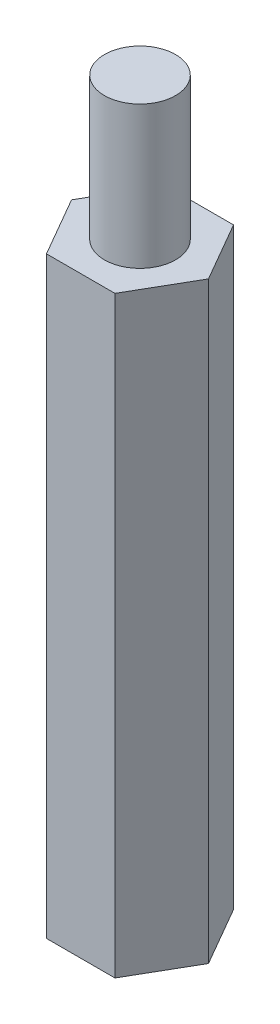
ISO-10303-21;
HEADER;
FILE_DESCRIPTION(('STEP AP214'),'2;1');
FILE_NAME('part.step','',(''),(''),'','','');
FILE_SCHEMA(('AUTOMOTIVE_DESIGN { 1 0 10303 214 1 1 1 1 }'));
ENDSEC;
DATA;
#1=APPLICATION_CONTEXT('core data for automotive mechanical design processes');
#2=APPLICATION_PROTOCOL_DEFINITION('international standard','automotive_design',2000,#1);
#3=PRODUCT_CONTEXT('',#1,'mechanical');
#4=PRODUCT('Part','Part','',(#3));
#5=PRODUCT_RELATED_PRODUCT_CATEGORY('part','',(#4));
#6=PRODUCT_DEFINITION_FORMATION('','',#4);
#7=PRODUCT_DEFINITION_CONTEXT('part definition',#1,'design');
#8=PRODUCT_DEFINITION('design','',#6,#7);
#9=PRODUCT_DEFINITION_SHAPE('','',#8);
#10=(LENGTH_UNIT() NAMED_UNIT(*) SI_UNIT(.MILLI.,.METRE.));
#11=(NAMED_UNIT(*) PLANE_ANGLE_UNIT() SI_UNIT($,.RADIAN.));
#12=(NAMED_UNIT(*) SI_UNIT($,.STERADIAN.) SOLID_ANGLE_UNIT());
#13=UNCERTAINTY_MEASURE_WITH_UNIT(LENGTH_MEASURE(1.E-05),#10,'distance_accuracy_value','');
#14=(GEOMETRIC_REPRESENTATION_CONTEXT(3) GLOBAL_UNCERTAINTY_ASSIGNED_CONTEXT((#13)) GLOBAL_UNIT_ASSIGNED_CONTEXT((#10,
#11,#12)) REPRESENTATION_CONTEXT('',''));
#15=CARTESIAN_POINT('',(0.,0.,0.));
#16=DIRECTION('',(0.,0.,1.));
#17=DIRECTION('',(1.,0.,0.));
#18=AXIS2_PLACEMENT_3D('',#15,#16,#17);
#19=CARTESIAN_POINT('',(0.,31.,0.));
#20=DIRECTION('',(0.,-1.,0.));
#21=DIRECTION('',(0.,0.,-1.));
#22=AXIS2_PLACEMENT_3D('',#19,#20,#21);
#23=CYLINDRICAL_SURFACE('',#22,1.5);
#24=CARTESIAN_POINT('',(0.,31.,0.));
#25=DIRECTION('',(0.,1.,0.));
#26=DIRECTION('',(0.,0.,1.));
#27=AXIS2_PLACEMENT_3D('',#24,#25,#26);
#28=CIRCLE('',#27,1.5);
#29=CARTESIAN_POINT('',(0.,31.,1.5));
#30=VERTEX_POINT('',#29);
#31=EDGE_CURVE('E11',#30,#30,#28,.T.);
#32=ORIENTED_EDGE('',*,*,#31,.F.);
#33=EDGE_LOOP('',(#32));
#34=FACE_BOUND('',#33,.T.);
#35=CARTESIAN_POINT('',(0.,25.,0.));
#36=DIRECTION('',(0.,1.,0.));
#37=DIRECTION('',(0.,0.,1.));
#38=AXIS2_PLACEMENT_3D('',#35,#36,#37);
#39=CIRCLE('',#38,1.5);
#40=CARTESIAN_POINT('',(0.,25.,1.5));
#41=VERTEX_POINT('',#40);
#42=EDGE_CURVE('E48',#41,#41,#39,.T.);
#43=ORIENTED_EDGE('',*,*,#42,.T.);
#44=EDGE_LOOP('',(#43));
#45=FACE_BOUND('',#44,.T.);
#46=ADVANCED_FACE('F45',(#34,#45),#23,.T.);
#47=CARTESIAN_POINT('',(0.,31.,0.));
#48=DIRECTION('',(0.,1.,0.));
#49=DIRECTION('',(0.,0.,1.));
#50=AXIS2_PLACEMENT_3D('',#47,#48,#49);
#51=PLANE('',#50);
#52=ORIENTED_EDGE('',*,*,#31,.T.);
#53=EDGE_LOOP('',(#52));
#54=FACE_BOUND('',#53,.T.);
#55=ADVANCED_FACE('F60',(#54),#51,.T.);
#56=CARTESIAN_POINT('',(0.,25.,0.));
#57=DIRECTION('',(0.,1.,0.));
#58=DIRECTION('',(0.,0.,1.));
#59=AXIS2_PLACEMENT_3D('',#56,#57,#58);
#60=PLANE('',#59);
#61=ORIENTED_EDGE('',*,*,#42,.F.);
#62=EDGE_LOOP('',(#61));
#63=FACE_BOUND('',#62,.T.);
#64=ADVANCED_FACE('F58',(#63),#60,.F.);
#65=CLOSED_SHELL('',(#46,#55,#64));
#66=MANIFOLD_SOLID_BREP('B2',#65);
#67=CARTESIAN_POINT('',(0.,25.,0.));
#68=DIRECTION('',(0.,1.,0.));
#69=DIRECTION('',(0.,0.,1.));
#70=AXIS2_PLACEMENT_3D('',#67,#68,#69);
#71=PLANE('',#70);
#72=DIRECTION('',(0.500000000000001,0.,-0.866025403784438));
#73=VECTOR('',#72,1.);
#74=CARTESIAN_POINT('',(1.44337567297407,25.,2.5));
#75=LINE('',#74,#73);
#76=CARTESIAN_POINT('',(1.44337567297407,25.,2.5));
#77=VERTEX_POINT('',#76);
#78=CARTESIAN_POINT('',(2.88675134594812,25.,0.));
#79=VERTEX_POINT('',#78);
#80=EDGE_CURVE('E182',#77,#79,#75,.T.);
#81=ORIENTED_EDGE('',*,*,#80,.T.);
#82=DIRECTION('',(-0.499999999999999,0.,-0.866025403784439));
#83=VECTOR('',#82,1.);
#84=CARTESIAN_POINT('',(2.88675134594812,25.,0.));
#85=LINE('',#84,#83);
#86=CARTESIAN_POINT('',(1.44337567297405,25.,-2.5));
#87=VERTEX_POINT('',#86);
#88=EDGE_CURVE('E140',#79,#87,#85,.T.);
#89=ORIENTED_EDGE('',*,*,#88,.T.);
#90=DIRECTION('',(-1.,0.,0.));
#91=VECTOR('',#90,1.);
#92=CARTESIAN_POINT('',(1.44337567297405,25.,-2.5));
#93=LINE('',#92,#91);
#94=CARTESIAN_POINT('',(-1.44337567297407,25.,-2.5));
#95=VERTEX_POINT('',#94);
#96=EDGE_CURVE('E153',#87,#95,#93,.T.);
#97=ORIENTED_EDGE('',*,*,#96,.T.);
#98=DIRECTION('',(-0.5,0.,0.866025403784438));
#99=VECTOR('',#98,1.);
#100=CARTESIAN_POINT('',(-1.44337567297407,25.,-2.5));
#101=LINE('',#100,#99);
#102=CARTESIAN_POINT('',(-2.88675134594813,25.,0.));
#103=VERTEX_POINT('',#102);
#104=EDGE_CURVE('E147',#95,#103,#101,.T.);
#105=ORIENTED_EDGE('',*,*,#104,.T.);
#106=DIRECTION('',(0.5,0.,0.866025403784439));
#107=VECTOR('',#106,1.);
#108=CARTESIAN_POINT('',(-2.88675134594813,25.,0.));
#109=LINE('',#108,#107);
#110=CARTESIAN_POINT('',(-1.44337567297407,25.,2.5));
#111=VERTEX_POINT('',#110);
#112=EDGE_CURVE('E151',#103,#111,#109,.T.);
#113=ORIENTED_EDGE('',*,*,#112,.T.);
#114=DIRECTION('',(1.,0.,0.));
#115=VECTOR('',#114,1.);
#116=CARTESIAN_POINT('',(-1.44337567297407,25.,2.5));
#117=LINE('',#116,#115);
#118=EDGE_CURVE('E103',#111,#77,#117,.T.);
#119=ORIENTED_EDGE('',*,*,#118,.T.);
#120=EDGE_LOOP('',(#81,#89,#97,#105,#113,#119));
#121=FACE_BOUND('',#120,.T.);
#122=CARTESIAN_POINT('',(0.,25.,0.));
#123=DIRECTION('',(0.,1.,0.));
#124=DIRECTION('',(0.,0.,1.));
#125=AXIS2_PLACEMENT_3D('',#122,#123,#124);
#126=CIRCLE('',#125,1.5);
#127=CARTESIAN_POINT('',(0.,25.,1.5));
#128=VERTEX_POINT('',#127);
#129=EDGE_CURVE('E175',#128,#128,#126,.T.);
#130=ORIENTED_EDGE('',*,*,#129,.F.);
#131=EDGE_LOOP('',(#130));
#132=FACE_BOUND('',#131,.T.);
#133=ADVANCED_FACE('F86',(#121,#132),#71,.T.);
#134=CARTESIAN_POINT('',(0.,0.,0.));
#135=DIRECTION('',(0.,1.,0.));
#136=DIRECTION('',(0.,0.,1.));
#137=AXIS2_PLACEMENT_3D('',#134,#135,#136);
#138=PLANE('',#137);
#139=DIRECTION('',(0.500000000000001,0.,-0.866025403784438));
#140=VECTOR('',#139,1.);
#141=CARTESIAN_POINT('',(1.44337567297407,0.,2.5));
#142=LINE('',#141,#140);
#143=CARTESIAN_POINT('',(1.44337567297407,0.,2.5));
#144=VERTEX_POINT('',#143);
#145=CARTESIAN_POINT('',(2.88675134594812,0.,0.));
#146=VERTEX_POINT('',#145);
#147=EDGE_CURVE('E171',#144,#146,#142,.T.);
#148=ORIENTED_EDGE('',*,*,#147,.F.);
#149=DIRECTION('',(1.,0.,0.));
#150=VECTOR('',#149,1.);
#151=CARTESIAN_POINT('',(-1.44337567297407,0.,2.5));
#152=LINE('',#151,#150);
#153=CARTESIAN_POINT('',(-1.44337567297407,0.,2.5));
#154=VERTEX_POINT('',#153);
#155=EDGE_CURVE('E132',#154,#144,#152,.T.);
#156=ORIENTED_EDGE('',*,*,#155,.F.);
#157=DIRECTION('',(0.5,0.,0.866025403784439));
#158=VECTOR('',#157,1.);
#159=CARTESIAN_POINT('',(-2.88675134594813,0.,0.));
#160=LINE('',#159,#158);
#161=CARTESIAN_POINT('',(-2.88675134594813,0.,0.));
#162=VERTEX_POINT('',#161);
#163=EDGE_CURVE('E126',#162,#154,#160,.T.);
#164=ORIENTED_EDGE('',*,*,#163,.F.);
#165=DIRECTION('',(-0.5,0.,0.866025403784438));
#166=VECTOR('',#165,1.);
#167=CARTESIAN_POINT('',(-1.44337567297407,0.,-2.5));
#168=LINE('',#167,#166);
#169=CARTESIAN_POINT('',(-1.44337567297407,0.,-2.5));
#170=VERTEX_POINT('',#169);
#171=EDGE_CURVE('E161',#170,#162,#168,.T.);
#172=ORIENTED_EDGE('',*,*,#171,.F.);
#173=DIRECTION('',(-1.,0.,0.));
#174=VECTOR('',#173,1.);
#175=CARTESIAN_POINT('',(1.44337567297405,0.,-2.5));
#176=LINE('',#175,#174);
#177=CARTESIAN_POINT('',(1.44337567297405,0.,-2.5));
#178=VERTEX_POINT('',#177);
#179=EDGE_CURVE('E177',#178,#170,#176,.T.);
#180=ORIENTED_EDGE('',*,*,#179,.F.);
#181=DIRECTION('',(-0.499999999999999,0.,-0.866025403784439));
#182=VECTOR('',#181,1.);
#183=CARTESIAN_POINT('',(2.88675134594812,0.,0.));
#184=LINE('',#183,#182);
#185=EDGE_CURVE('E174',#146,#178,#184,.T.);
#186=ORIENTED_EDGE('',*,*,#185,.F.);
#187=EDGE_LOOP('',(#148,#156,#164,#172,#180,#186));
#188=FACE_BOUND('',#187,.T.);
#189=CARTESIAN_POINT('',(0.,0.,0.));
#190=DIRECTION('',(0.,1.,0.));
#191=DIRECTION('',(0.,0.,1.));
#192=AXIS2_PLACEMENT_3D('',#189,#190,#191);
#193=CIRCLE('',#192,1.5);
#194=CARTESIAN_POINT('',(0.,0.,1.5));
#195=VERTEX_POINT('',#194);
#196=EDGE_CURVE('E275',#195,#195,#193,.T.);
#197=ORIENTED_EDGE('',*,*,#196,.T.);
#198=EDGE_LOOP('',(#197));
#199=FACE_BOUND('',#198,.T.);
#200=ADVANCED_FACE('F191',(#188,#199),#138,.F.);
#201=CARTESIAN_POINT('',(1.44337567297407,25.,2.5));
#202=DIRECTION('',(-0.866025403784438,0.,-0.500000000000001));
#203=DIRECTION('',(-0.500000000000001,0.,0.866025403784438));
#204=AXIS2_PLACEMENT_3D('',#201,#202,#203);
#205=PLANE('',#204);
#206=ORIENTED_EDGE('',*,*,#147,.T.);
#207=DIRECTION('',(0.,-1.,0.));
#208=VECTOR('',#207,1.);
#209=CARTESIAN_POINT('',(2.88675134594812,25.,0.));
#210=LINE('',#209,#208);
#211=EDGE_CURVE('E43',#79,#146,#210,.T.);
#212=ORIENTED_EDGE('',*,*,#211,.F.);
#213=ORIENTED_EDGE('',*,*,#80,.F.);
#214=DIRECTION('',(0.,-1.,0.));
#215=VECTOR('',#214,1.);
#216=CARTESIAN_POINT('',(1.44337567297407,25.,2.5));
#217=LINE('',#216,#215);
#218=EDGE_CURVE('E167',#77,#144,#217,.T.);
#219=ORIENTED_EDGE('',*,*,#218,.T.);
#220=EDGE_LOOP('',(#206,#212,#213,#219));
#221=FACE_BOUND('',#220,.T.);
#222=ADVANCED_FACE('F88',(#221),#205,.F.);
#223=CARTESIAN_POINT('',(2.88675134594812,25.,0.));
#224=DIRECTION('',(-0.866025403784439,0.,0.499999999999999));
#225=DIRECTION('',(0.5,0.,0.866025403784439));
#226=AXIS2_PLACEMENT_3D('',#223,#224,#225);
#227=PLANE('',#226);
#228=ORIENTED_EDGE('',*,*,#185,.T.);
#229=DIRECTION('',(0.,-1.,0.));
#230=VECTOR('',#229,1.);
#231=CARTESIAN_POINT('',(1.44337567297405,25.,-2.5));
#232=LINE('',#231,#230);
#233=EDGE_CURVE('E95',#87,#178,#232,.T.);
#234=ORIENTED_EDGE('',*,*,#233,.F.);
#235=ORIENTED_EDGE('',*,*,#88,.F.);
#236=ORIENTED_EDGE('',*,*,#211,.T.);
#237=EDGE_LOOP('',(#228,#234,#235,#236));
#238=FACE_BOUND('',#237,.T.);
#239=ADVANCED_FACE('F216',(#238),#227,.F.);
#240=CARTESIAN_POINT('',(1.44337567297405,25.,-2.5));
#241=DIRECTION('',(0.,0.,1.));
#242=DIRECTION('',(1.,0.,0.));
#243=AXIS2_PLACEMENT_3D('',#240,#241,#242);
#244=PLANE('',#243);
#245=ORIENTED_EDGE('',*,*,#179,.T.);
#246=DIRECTION('',(0.,-1.,0.));
#247=VECTOR('',#246,1.);
#248=CARTESIAN_POINT('',(-1.44337567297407,25.,-2.5));
#249=LINE('',#248,#247);
#250=EDGE_CURVE('E162',#95,#170,#249,.T.);
#251=ORIENTED_EDGE('',*,*,#250,.F.);
#252=ORIENTED_EDGE('',*,*,#96,.F.);
#253=ORIENTED_EDGE('',*,*,#233,.T.);
#254=EDGE_LOOP('',(#245,#251,#252,#253));
#255=FACE_BOUND('',#254,.T.);
#256=ADVANCED_FACE('F188',(#255),#244,.F.);
#257=CARTESIAN_POINT('',(-1.44337567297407,25.,-2.5));
#258=DIRECTION('',(0.866025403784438,0.,0.5));
#259=DIRECTION('',(0.5,0.,-0.866025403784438));
#260=AXIS2_PLACEMENT_3D('',#257,#258,#259);
#261=PLANE('',#260);
#262=ORIENTED_EDGE('',*,*,#171,.T.);
#263=DIRECTION('',(0.,-1.,0.));
#264=VECTOR('',#263,1.);
#265=CARTESIAN_POINT('',(-2.88675134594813,25.,0.));
#266=LINE('',#265,#264);
#267=EDGE_CURVE('E158',#103,#162,#266,.T.);
#268=ORIENTED_EDGE('',*,*,#267,.F.);
#269=ORIENTED_EDGE('',*,*,#104,.F.);
#270=ORIENTED_EDGE('',*,*,#250,.T.);
#271=EDGE_LOOP('',(#262,#268,#269,#270));
#272=FACE_BOUND('',#271,.T.);
#273=ADVANCED_FACE('F159',(#272),#261,.F.);
#274=CARTESIAN_POINT('',(-2.88675134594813,25.,0.));
#275=DIRECTION('',(0.866025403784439,0.,-0.5));
#276=DIRECTION('',(-0.5,0.,-0.866025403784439));
#277=AXIS2_PLACEMENT_3D('',#274,#275,#276);
#278=PLANE('',#277);
#279=ORIENTED_EDGE('',*,*,#163,.T.);
#280=DIRECTION('',(0.,-1.,0.));
#281=VECTOR('',#280,1.);
#282=CARTESIAN_POINT('',(-1.44337567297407,25.,2.5));
#283=LINE('',#282,#281);
#284=EDGE_CURVE('E163',#111,#154,#283,.T.);
#285=ORIENTED_EDGE('',*,*,#284,.F.);
#286=ORIENTED_EDGE('',*,*,#112,.F.);
#287=ORIENTED_EDGE('',*,*,#267,.T.);
#288=EDGE_LOOP('',(#279,#285,#286,#287));
#289=FACE_BOUND('',#288,.T.);
#290=ADVANCED_FACE('F165',(#289),#278,.F.);
#291=CARTESIAN_POINT('',(-1.44337567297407,25.,2.5));
#292=DIRECTION('',(0.,0.,-1.));
#293=DIRECTION('',(-1.,0.,0.));
#294=AXIS2_PLACEMENT_3D('',#291,#292,#293);
#295=PLANE('',#294);
#296=ORIENTED_EDGE('',*,*,#155,.T.);
#297=ORIENTED_EDGE('',*,*,#218,.F.);
#298=ORIENTED_EDGE('',*,*,#118,.F.);
#299=ORIENTED_EDGE('',*,*,#284,.T.);
#300=EDGE_LOOP('',(#296,#297,#298,#299));
#301=FACE_BOUND('',#300,.T.);
#302=ADVANCED_FACE('F196',(#301),#295,.F.);
#303=CARTESIAN_POINT('',(0.,25.,0.));
#304=DIRECTION('',(0.,-1.,0.));
#305=DIRECTION('',(0.,0.,-1.));
#306=AXIS2_PLACEMENT_3D('',#303,#304,#305);
#307=CYLINDRICAL_SURFACE('',#306,1.5);
#308=ORIENTED_EDGE('',*,*,#129,.T.);
#309=EDGE_LOOP('',(#308));
#310=FACE_BOUND('',#309,.T.);
#311=ORIENTED_EDGE('',*,*,#196,.F.);
#312=EDGE_LOOP('',(#311));
#313=FACE_BOUND('',#312,.T.);
#314=ADVANCED_FACE('F198',(#310,#313),#307,.F.);
#315=CLOSED_SHELL('',(#133,#200,#222,#239,#256,#273,#290,#302,#314));
#316=MANIFOLD_SOLID_BREP('B6',#315);
#317=ADVANCED_BREP_SHAPE_REPRESENTATION('',(#18,#66,#316),#14);
#318=SHAPE_DEFINITION_REPRESENTATION(#9,#317);
ENDSEC;
END-ISO-10303-21;
